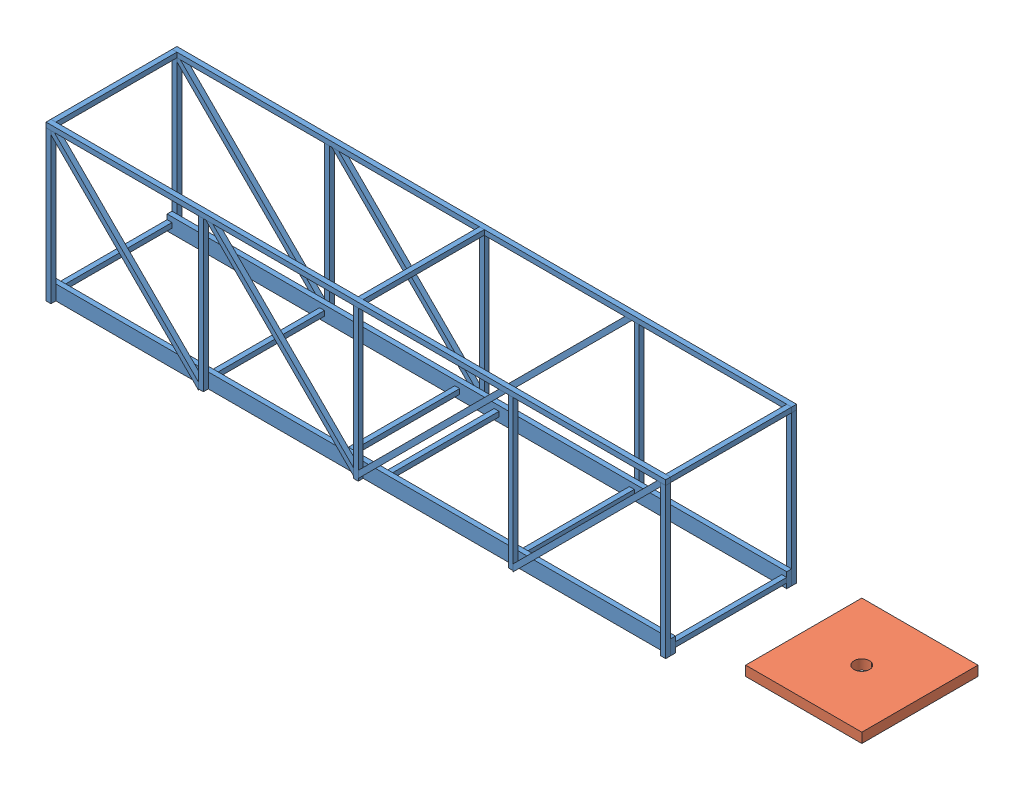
SolidWorks assembly Test_Block_Assembly.SLDASM, configuration Default (file format 5000). Lengths in mm.
Overall size (520.28 100.66 84.53).
2 component instances, 2 part files, 2 mates.
Components (placement in the parent):
- Test_Block_Truss-1: Test_Block_Truss.SLDPRT [Default<As Machined>] at origin size (400 100.66 84.53)
- Load_Plate_75-1: Load_Plate_75.SLDPRT [Default] at (282.7836 4.7625 -1.5875) size (75 6.35 75)
Mates (geometry in assembly coordinates):
- Coincident1: coincident anti-aligned: plane of Test_Block_Truss-1 through (200 4.7625 -35.9125) normal (0 1 0); plane of Load_Plate_75-1 through (320.2836 4.7625 35.9125) normal (0 -1 0)
- Coincident2: coincident anti-aligned: plane of Test_Block_Truss-1 through (196.825 95.2375 -39.0875) normal (0 0 1); plane of Load_Plate_75-1 through (245.2836 11.1125 -39.0875) normal (0 0 -1)
